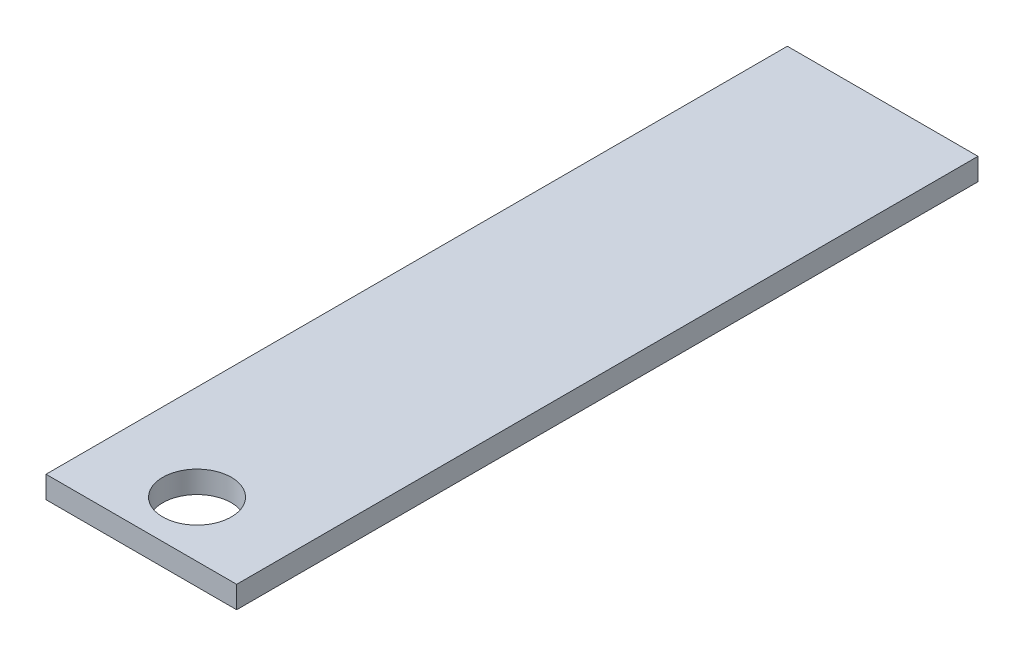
from build123d import *

# Parameters (mm, degrees)
SKETCH3_W           = 61.722
SKETCH3_H           = 7.14375
BOSS_EXTRUDE1_DEPTH = 120
CUT_EXTRUDE1_REACH  = 126.111
SKETCH5_R           = 11.1125


with BuildPart() as part:
    # Sketch3 → Boss-Extrude1 (new, symmetric)
    with BuildSketch(Plane.XY):
        Rectangle(SKETCH3_W, SKETCH3_H)
    extrude(amount=BOSS_EXTRUDE1_DEPTH, both=True)

    # Sketch5 → Cut-Extrude1 (cut, up to next)
    with BuildSketch(Plane.XZ.offset(3.571875), mode=Mode.PRIVATE) as cut_extrude1_sk1:
        with Locations(Location((0, 101.966, 0), (0, 0, 270))):
            Circle(SKETCH5_R)
    cut_extrude1_tool1 = extrude(cut_extrude1_sk1.sketch, amount=-CUT_EXTRUDE1_REACH, mode=Mode.PRIVATE) & part.part
    add(cut_extrude1_tool1.solids().sort_by_distance((0, -3.571875, 101.966))[0], mode=Mode.SUBTRACT)


solid = part.part
